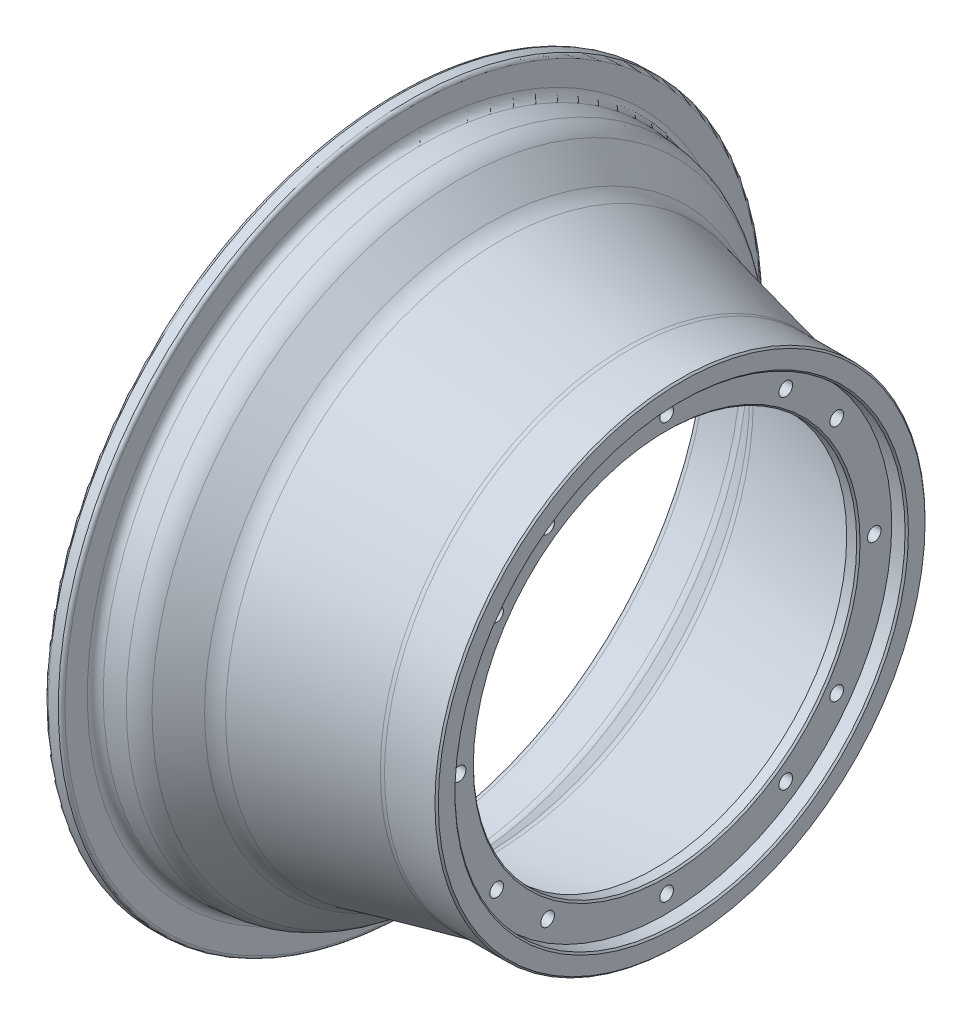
from build123d import *

# Parameters (mm, degrees)
SKETCH2_R          = 4.1
CUT_EXTRUDE1_DEPTH = 10
CIRPATTERN1_COUNT  = 4
FILLET1_R          = 10
FILLET2_R          = 18
FILLET3_R          = 10
CHAMFER1_SIZE      = 1
FILLET4_R          = 2
FILLET5_R          = 5
FILLET6_R          = 2
SKETCH4_R          = 6
CUT_EXTRUDE2_DEPTH = 28


with BuildPart() as part:
    # Sketch1 → Revolve1 (revolve)
    with BuildSketch(Plane.XY, mode=Mode.PRIVATE) as revolve1_sk:
        Polygon((0, 135), (-9, 135), (-9, 115), (-16, 115), (-16, 135), (-117.476104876, 158.427604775), (-141.4, 180.719668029), (-171.4, 183.344327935), (-171.4, 210.5), (-161.4, 210.5), (-161.4, 190.5), (-137.960342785, 188.449295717), (-113.589462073, 165.740735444), (-32.414418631, 147), (0, 147), align=None)
    revolve(revolve1_sk.sketch.rotate(Axis((0, 0, 0), (-1, 0, 0)), 90), axis=Axis((0, 0, 0), (-1, 0, 0)))

    # Sketch2 → Cut-Extrude1 (cut)
    with BuildSketch(Plane.ZY.offset(16)):
        with Locations((0, 124.5)):
            Circle(SKETCH2_R)
        with Locations((71.410266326, 101.984429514)):
            Circle(SKETCH2_R)
        with Locations((101.984429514, 71.410266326)):
            Circle(SKETCH2_R)
    cut_extrude1 = extrude(amount=-CUT_EXTRUDE1_DEPTH, mode=Mode.SUBTRACT)

    # CirPattern1: Cut-Extrude1 ×4 about axis
    cirpattern1_axis = Axis((0, 0, 0), (1, 0, 0))
    for i in range(1, CIRPATTERN1_COUNT):
        add(cut_extrude1.rotate(cirpattern1_axis, i * 360 / CIRPATTERN1_COUNT), mode=Mode.SUBTRACT)

    # Fillet1
    fillet1_edges = [part.edges().sort_by_distance(p)[0] for p in [
        (-141.4, 0, 180.719668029),
        (-117.476104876, 0, 158.427604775),
    ]]
    fillet(fillet1_edges, radius=FILLET1_R)

    # Fillet2
    fillet2_edges = [part.edges().sort_by_distance(p)[0] for p in [
        (-113.589462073, 0, 165.740735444),
        (-137.960342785, 0, 188.449295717),
    ]]
    fillet(fillet2_edges, radius=FILLET2_R)

    # Fillet3
    fillet3_edges = [part.edges().sort_by_distance(p)[0] for p in [
        (-32.414418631, 0, 147),
    ]]
    fillet(fillet3_edges, radius=FILLET3_R)

    # Chamfer1
    chamfer1_edges = [part.edges().sort_by_distance(p)[0] for p in [
        (0, 0, 147),
        (-9, 0, 115),
        (0, 0, 135),
    ]]
    chamfer(chamfer1_edges, length=CHAMFER1_SIZE)

    # Fillet4
    fillet4_edges = [part.edges().sort_by_distance(p)[0] for p in [
        (-16, 0, 135),
    ]]
    fillet(fillet4_edges, radius=FILLET4_R)

    # Fillet5
    fillet5_edges = [part.edges().sort_by_distance(p)[0] for p in [
        (-161.4, 0, 190.5),
        (-171.4, 0, 183.344327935),
    ]]
    fillet(fillet5_edges, radius=FILLET5_R)

    # Fillet6
    fillet6_edges = [part.edges().sort_by_distance(p)[0] for p in [
        (-161.4, 0, 210.5),
        (-171.4, 0, 210.5),
    ]]
    fillet(fillet6_edges, radius=FILLET6_R)

    # Sketch4 → Cut-Extrude2 (cut)
    with BuildSketch(Plane(origin=(-136.277769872, -161.673108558, 0), x_dir=(0.731617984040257, 0.6817148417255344, 0), z_dir=(-0.6817148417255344, 0.731617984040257, 0))):
        with Locations(Location((0, 0, 0), (0, 0, 169.73793256))):
            Circle(SKETCH4_R)
    extrude(amount=-CUT_EXTRUDE2_DEPTH, mode=Mode.SUBTRACT)


solid = part.part
